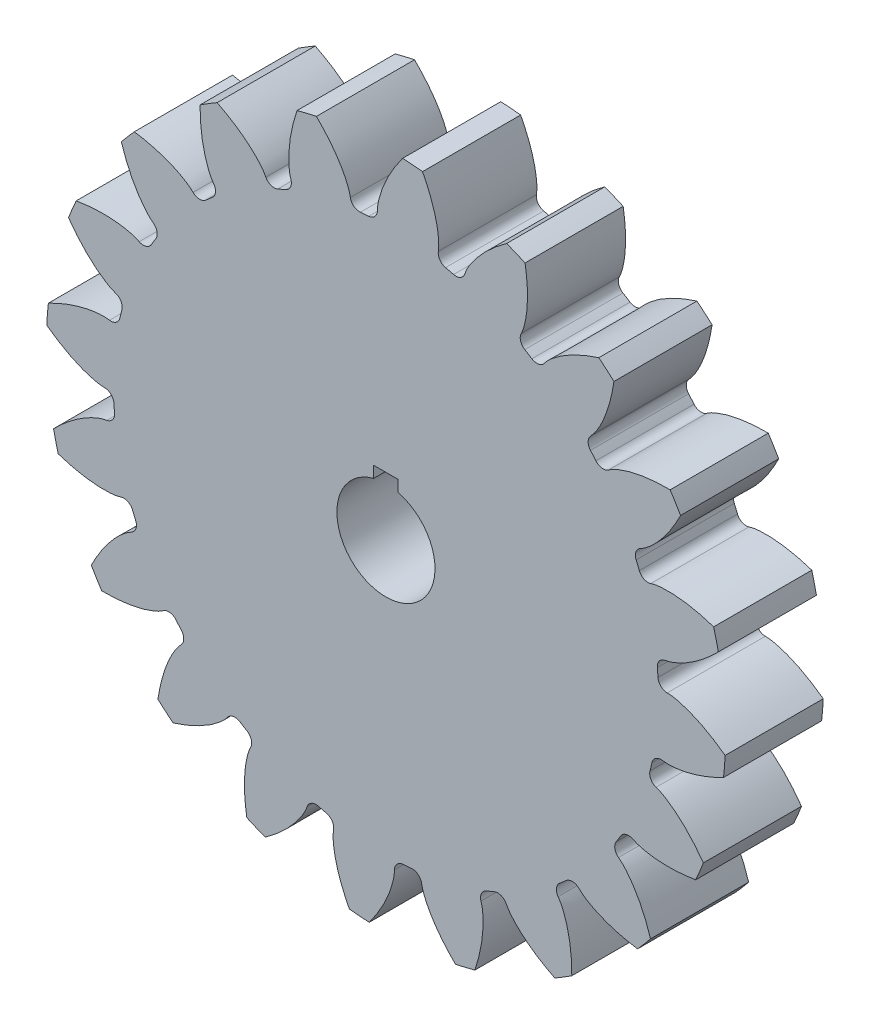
from build123d import *

# Parameters (mm, degrees)
SKETCH2_R                = 22.225
EXTRUDE1_DEPTH           = 8
EXTRUDE2_DEPTH           = 8
FILLET1_R                = 0.762
CIRPATTERN1_COUNT        = 20
FILLET1_OF_CIRPATTERN1_R = 0.762
SCALE1_SCALE             = 0.25
SKETCH4_R                = 1
EXTRUDE3_DEPTH           = 10.979130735
SKETCH5_W                = 0.5
SKETCH5_H                = 1.2
EXTRUDE4_DEPTH           = 10.979130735


with BuildPart() as part:
    # Sketch2 → Extrude1 (new body)
    with BuildSketch(Plane.XY):
        Circle(SKETCH2_R)
    extrude(amount=EXTRUDE1_DEPTH)

    # Sketch1 → Extrude2 (add)
    with BuildSketch(Plane.XY):
        with BuildLine():
            ThreePointArc((1.360227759, 27.652565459), (2.1724996, 27.600631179), (2.982893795, 27.524842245))
            add(Edge.make_bspline(
                [(4.133540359, 21.837226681), (4.190852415, 22.096408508), (4.262970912, 22.422549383), (4.318000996, 22.959239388), (4.291551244, 23.577530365), (4.131380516, 24.593926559), (3.809867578, 25.663101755), (3.40374223, 26.681704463), (3.128277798, 27.23357647), (2.982893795, 27.524842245)],
                knots=[0, 0, 0, 0, 0.134075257, 0.168713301, 0.272604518, 0.445753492, 0.688160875, 0.835418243, 1, 1, 1, 1], degree=3))
            ThreePointArc((4.133540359, 21.837226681), (1.743979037, 22.156469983), (-0.666102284, 22.215015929))
            add(Edge.make_bspline(
                [(-0.666102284, 22.215015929), (-0.682158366, 22.479972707), (-0.702362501, 22.813380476), (-0.672747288, 23.352070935), (-0.549888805, 23.958609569), (-0.232670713, 24.937429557), (0.252160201, 25.943135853), (0.812649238, 26.885654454), (1.171064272, 27.38763257), (1.360227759, 27.652565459)],
                knots=[0, 0, 0, 0, 0.134075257, 0.168713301, 0.272604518, 0.445753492, 0.688160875, 0.835418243, 1, 1, 1, 1], degree=3))
        make_face()
    extrude2 = extrude(amount=EXTRUDE2_DEPTH)

    # Fillet1
    fillet1_edges = [part.edges().sort_by_distance(p)[0] for p in [
        (4.133540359, 21.837226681, 4),
        (-0.666102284, 22.215015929, 4),
    ]]
    fillet(fillet1_edges, radius=FILLET1_R)

    # CirPattern1: Extrude2 ×20 about axis
    cirpattern1_axis = Axis((0, 0, 8), (0, 0, -1))
    for i in range(1, CIRPATTERN1_COUNT):
        add(extrude2.rotate(cirpattern1_axis, i * 360 / CIRPATTERN1_COUNT))

    # Fillet1 of CirPattern1
    fillet1_of_cirpattern1_edges = [part.edges().sort_by_distance(p)[0] for p in [
        (10.679304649, 19.491102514, 4),
        (6.231316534, 21.333572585, 4),
        (16.179704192, 15.237053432, 4),
        (12.518770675, 18.363850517, 4),
        (20.096321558, 9.491495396, 4),
        (17.580800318, 13.596546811, 4),
        (22.04577095, 2.81684366, 4),
        (20.921898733, 7.498318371, 4),
        (21.837226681, -4.133540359, 4),
        (22.215015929, 0.666102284, 4),
        (19.491102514, -10.679304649, 4),
        (21.333572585, -6.231316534, 4),
        (15.237053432, -16.179704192, 4),
        (18.363850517, -12.518770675, 4),
        (9.491495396, -20.096321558, 4),
        (13.596546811, -17.580800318, 4),
        (2.81684366, -22.04577095, 4),
        (7.498318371, -20.921898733, 4),
        (-4.133540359, -21.837226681, 4),
        (0.666102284, -22.215015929, 4),
        (-10.679304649, -19.491102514, 4),
        (-6.231316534, -21.333572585, 4),
        (-16.179704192, -15.237053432, 4),
        (-12.518770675, -18.363850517, 4),
        (-20.096321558, -9.491495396, 4),
        (-17.580800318, -13.596546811, 4),
        (-22.04577095, -2.81684366, 4),
        (-20.921898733, -7.498318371, 4),
        (-21.837226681, 4.133540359, 4),
        (-22.215015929, -0.666102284, 4),
        (-19.491102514, 10.679304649, 4),
        (-21.333572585, 6.231316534, 4),
        (-15.237053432, 16.179704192, 4),
        (-18.363850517, 12.518770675, 4),
        (-9.491495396, 20.096321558, 4),
        (-13.596546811, 17.580800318, 4),
        (-2.81684366, 22.04577095, 4),
        (-7.498318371, 20.921898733, 4),
    ]]
    fillet(fillet1_of_cirpattern1_edges, radius=FILLET1_OF_CIRPATTERN1_R)


with BuildPart() as part_1:
    # Scale1: scaled about (0, 0, 4)
    add(part.part.scale(SCALE1_SCALE).moved(Location((0, 0, 3))))

    # Sketch4 → Extrude3 (cut, through all)
    with BuildSketch(Plane.XY.offset(5)):
        Circle(SKETCH4_R)
    extrude(amount=-EXTRUDE3_DEPTH, mode=Mode.SUBTRACT)

    # Sketch5 → Extrude4 (cut, through all)
    with BuildSketch(Plane.XY.offset(5)):
        with Locations((0, 0.6)):
            Rectangle(SKETCH5_W, SKETCH5_H)
    extrude(amount=-EXTRUDE4_DEPTH, mode=Mode.SUBTRACT)


solid = part_1.part
